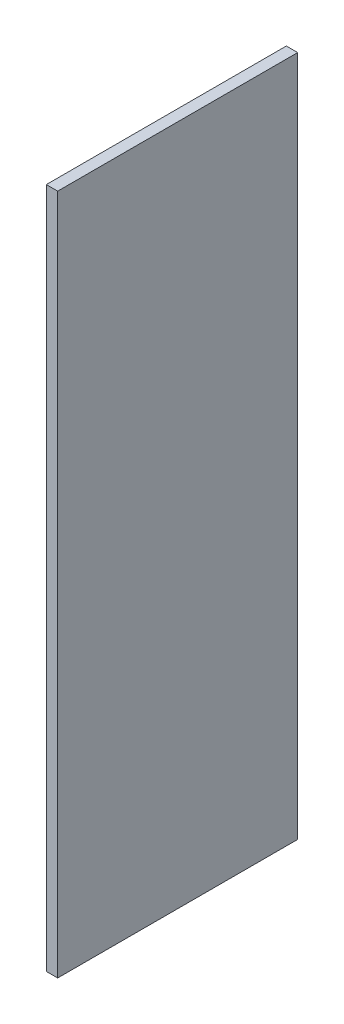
from build123d import *

# Parameters (mm, degrees)
ESQUISSE1_W        = 63.4
ESQUISSE1_H        = 180
BOSS_EXTRU_1_DEPTH = 1.5


with BuildPart() as part:
    # Esquisse1 → Boss.-Extru.1 (new, symmetric)
    with BuildSketch(Plane(origin=(0, 0, 0), x_dir=(0, 0, -1), z_dir=(1, 0, 0))):
        Rectangle(ESQUISSE1_W, ESQUISSE1_H)
    extrude(amount=BOSS_EXTRU_1_DEPTH, both=True)


solid = part.part
